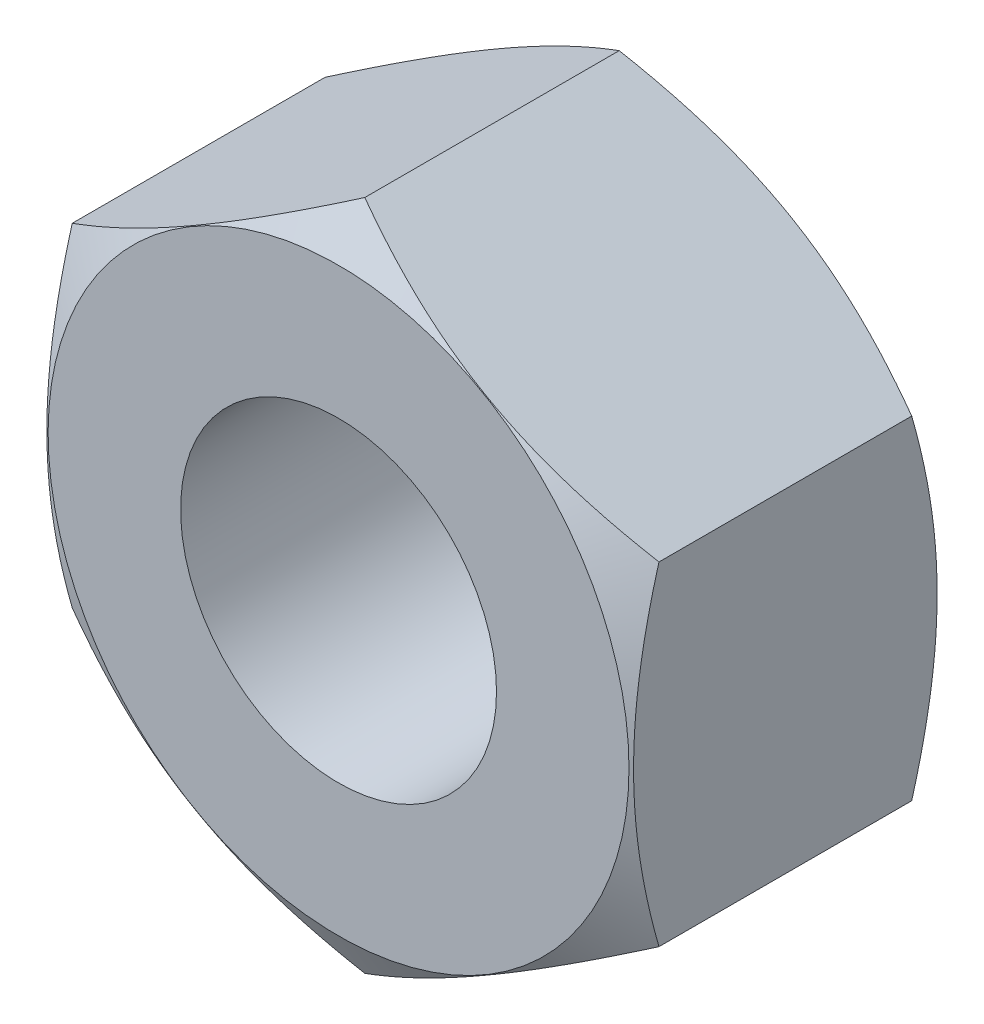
ISO-10303-21;
HEADER;
FILE_DESCRIPTION(('STEP AP214'),'2;1');
FILE_NAME('part.step','',(''),(''),'','','');
FILE_SCHEMA(('AUTOMOTIVE_DESIGN { 1 0 10303 214 1 1 1 1 }'));
ENDSEC;
DATA;
#1=APPLICATION_CONTEXT('core data for automotive mechanical design processes');
#2=APPLICATION_PROTOCOL_DEFINITION('international standard','automotive_design',2000,#1);
#3=PRODUCT_CONTEXT('',#1,'mechanical');
#4=PRODUCT('Part','Part','',(#3));
#5=PRODUCT_RELATED_PRODUCT_CATEGORY('part','',(#4));
#6=PRODUCT_DEFINITION_FORMATION('','',#4);
#7=PRODUCT_DEFINITION_CONTEXT('part definition',#1,'design');
#8=PRODUCT_DEFINITION('design','',#6,#7);
#9=PRODUCT_DEFINITION_SHAPE('','',#8);
#10=(LENGTH_UNIT() NAMED_UNIT(*) SI_UNIT(.MILLI.,.METRE.));
#11=(NAMED_UNIT(*) PLANE_ANGLE_UNIT() SI_UNIT($,.RADIAN.));
#12=(NAMED_UNIT(*) SI_UNIT($,.STERADIAN.) SOLID_ANGLE_UNIT());
#13=UNCERTAINTY_MEASURE_WITH_UNIT(LENGTH_MEASURE(1.E-05),#10,'distance_accuracy_value','');
#14=(GEOMETRIC_REPRESENTATION_CONTEXT(3) GLOBAL_UNCERTAINTY_ASSIGNED_CONTEXT((#13)) GLOBAL_UNIT_ASSIGNED_CONTEXT((#10,
#11,#12)) REPRESENTATION_CONTEXT('',''));
#15=CARTESIAN_POINT('',(0.,0.,0.));
#16=DIRECTION('',(0.,0.,1.));
#17=DIRECTION('',(1.,0.,0.));
#18=AXIS2_PLACEMENT_3D('',#15,#16,#17);
#19=CARTESIAN_POINT('',(0.,0.,0.));
#20=DIRECTION('',(0.,0.,1.));
#21=DIRECTION('',(1.,0.,0.));
#22=AXIS2_PLACEMENT_3D('',#19,#20,#21);
#23=PLANE('',#22);
#24=CARTESIAN_POINT('',(0.,0.,0.));
#25=DIRECTION('',(0.,0.,1.));
#26=DIRECTION('',(1.,0.,0.));
#27=AXIS2_PLACEMENT_3D('',#24,#25,#26);
#28=CIRCLE('',#27,3.5);
#29=CARTESIAN_POINT('',(3.5,0.,0.));
#30=VERTEX_POINT('',#29);
#31=EDGE_CURVE('E218',#30,#30,#28,.T.);
#32=ORIENTED_EDGE('',*,*,#31,.T.);
#33=EDGE_LOOP('',(#32));
#34=FACE_BOUND('',#33,.T.);
#35=CARTESIAN_POINT('',(0.,0.,0.));
#36=DIRECTION('',(0.,0.,1.));
#37=DIRECTION('',(1.,0.,0.));
#38=AXIS2_PLACEMENT_3D('',#35,#36,#37);
#39=CIRCLE('',#38,6.43576951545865);
#40=CARTESIAN_POINT('',(6.43576951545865,0.,0.));
#41=VERTEX_POINT('',#40);
#42=EDGE_CURVE('E188',#41,#41,#39,.F.);
#43=ORIENTED_EDGE('',*,*,#42,.T.);
#44=EDGE_LOOP('',(#43));
#45=FACE_BOUND('',#44,.T.);
#46=ADVANCED_FACE('F27',(#34,#45),#23,.F.);
#47=CARTESIAN_POINT('',(0.,0.,0.600000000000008));
#48=DIRECTION('',(0.,0.,1.));
#49=DIRECTION('',(1.,0.,0.));
#50=AXIS2_PLACEMENT_3D('',#47,#48,#49);
#51=CONICAL_SURFACE('',#50,7.475,1.0471975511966);
#52=ORIENTED_EDGE('',*,*,#42,.F.);
#53=EDGE_LOOP('',(#52));
#54=FACE_BOUND('',#53,.T.);
#55=CARTESIAN_POINT('',(-6.5,-9.74231945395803,3.04603206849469));
#56=CARTESIAN_POINT('',(-6.5,-9.46314742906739,2.91199346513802));
#57=CARTESIAN_POINT('',(-6.5,-9.18330188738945,2.7793320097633));
#58=CARTESIAN_POINT('',(-6.5,-8.62190795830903,2.51753740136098));
#59=CARTESIAN_POINT('',(-6.5,-8.34035928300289,2.38840486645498));
#60=CARTESIAN_POINT('',(-6.5,-7.7737170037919,2.13377787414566));
#61=CARTESIAN_POINT('',(-6.5,-7.48861237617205,2.00830785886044));
#62=CARTESIAN_POINT('',(-6.5,-6.91604248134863,1.7628958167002));
#63=CARTESIAN_POINT('',(-6.5,-6.62857733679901,1.642953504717));
#64=CARTESIAN_POINT('',(-6.5,-6.04772360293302,1.40879881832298));
#65=CARTESIAN_POINT('',(-6.5,-5.75430454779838,1.2946615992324));
#66=CARTESIAN_POINT('',(-6.5,-5.16402976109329,1.0754827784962));
#67=CARTESIAN_POINT('',(-6.5,-4.86717367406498,0.970442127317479));
#68=CARTESIAN_POINT('',(-6.5,-4.27017248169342,0.772248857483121));
#69=CARTESIAN_POINT('',(-6.5,-3.97003563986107,0.67907161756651));
#70=CARTESIAN_POINT('',(-6.5,-3.36559758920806,0.50757556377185));
#71=CARTESIAN_POINT('',(-6.5,-3.06129765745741,0.429252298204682));
#72=CARTESIAN_POINT('',(-6.5,-2.44151271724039,0.289635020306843));
#73=CARTESIAN_POINT('',(-6.5,-2.12592995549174,0.228762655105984));
#74=CARTESIAN_POINT('',(-6.5,-1.64983467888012,0.155074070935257));
#75=CARTESIAN_POINT('',(-6.5,-1.4906633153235,0.133446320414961));
#76=CARTESIAN_POINT('',(-6.5,-1.1715966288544,0.0964905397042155));
#77=CARTESIAN_POINT('',(-6.5,-1.01170137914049,0.081161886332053));
#78=CARTESIAN_POINT('',(-6.5,-0.692351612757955,0.0572115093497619));
#79=CARTESIAN_POINT('',(-6.5,-0.532900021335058,0.0485509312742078));
#80=CARTESIAN_POINT('',(-6.5,-0.213773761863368,0.0379860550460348));
#81=CARTESIAN_POINT('',(-6.5,-0.0540990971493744,0.0360816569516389));
#82=CARTESIAN_POINT('',(-6.5,0.265143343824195,0.0390742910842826));
#83=CARTESIAN_POINT('',(-6.5,0.424711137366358,0.0439694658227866));
#84=CARTESIAN_POINT('',(-6.5,0.743503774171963,0.0604413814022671));
#85=CARTESIAN_POINT('',(-6.5,0.902728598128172,0.0720184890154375));
#86=CARTESIAN_POINT('',(-6.5,1.29058202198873,0.108118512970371));
#87=CARTESIAN_POINT('',(-6.5,1.5188950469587,0.136097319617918));
#88=CARTESIAN_POINT('',(-6.5,1.97368947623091,0.204220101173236));
#89=CARTESIAN_POINT('',(-6.5,2.20017059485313,0.244365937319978));
#90=CARTESIAN_POINT('',(-6.5,2.87728306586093,0.381035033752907));
#91=CARTESIAN_POINT('',(-6.5,3.32469250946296,0.493696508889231));
#92=CARTESIAN_POINT('',(-6.5,3.99374728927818,0.687398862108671));
#93=CARTESIAN_POINT('',(-6.5,4.21890306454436,0.756998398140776));
#94=CARTESIAN_POINT('',(-6.5,4.66703989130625,0.903002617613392));
#95=CARTESIAN_POINT('',(-6.5,4.89002074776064,0.979407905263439));
#96=CARTESIAN_POINT('',(-6.5,5.33269256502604,1.13739679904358));
#97=CARTESIAN_POINT('',(-6.5,5.55239501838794,1.21894852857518));
#98=CARTESIAN_POINT('',(-6.5,5.98994019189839,1.38668810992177));
#99=CARTESIAN_POINT('',(-6.5,6.20778352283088,1.47287436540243));
#100=CARTESIAN_POINT('',(-6.5,6.42484560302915,1.56094206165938));
#101=B_SPLINE_CURVE_WITH_KNOTS('',3,(#55,#56,#57,#58,#59,#60,#61,#62,#63,#64,#65,#66,#67,#68,
#69,#70,#71,#72,#73,#74,#75,#76,#77,#78,#79,#80,#81,#82,#83,#84,#85,#86,#87,#88,#89,#90,#91,#92,
#93,#94,#95,#96,#97,#98,#99,#100),.UNSPECIFIED.,.F.,.F.,(4,2,2,2,2,2,2,2,2,2,2,2,2,2,2,2,2,2,2,
2,2,2,4),(0.,0.929060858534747,1.85828342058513,2.79271315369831,3.72709463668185,
4.67148670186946,5.61597732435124,6.55847464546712,7.50068905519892,8.46404999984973,
8.94584702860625,9.42759638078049,9.90651690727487,10.385430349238,10.8642129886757,
11.3430219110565,12.0326915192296,12.7224666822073,14.1046928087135,14.8116425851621,
15.5186551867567,16.2216521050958,16.9244084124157),.UNSPECIFIED.);
#102=CARTESIAN_POINT('',(-6.5,-3.69129042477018,0.600000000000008));
#103=VERTEX_POINT('',#102);
#104=CARTESIAN_POINT('',(-6.5,3.69129042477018,0.600000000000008));
#105=VERTEX_POINT('',#104);
#106=EDGE_CURVE('E82',#103,#105,#101,.T.);
#107=ORIENTED_EDGE('',*,*,#106,.T.);
#108=CARTESIAN_POINT('',(-6.5002,3.69117495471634,0.600067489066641));
#109=CARTESIAN_POINT('',(-6.21605663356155,3.85522520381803,0.504144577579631));
#110=CARTESIAN_POINT('',(-5.92939800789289,4.02072763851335,0.416694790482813));
#111=CARTESIAN_POINT('',(-5.35104770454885,4.35463834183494,0.263540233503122));
#112=CARTESIAN_POINT('',(-5.0593452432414,4.52305283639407,0.197890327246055));
#113=CARTESIAN_POINT('',(-4.62271930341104,4.7751389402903,0.120365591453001));
#114=CARTESIAN_POINT('',(-4.47917121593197,4.85801646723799,0.0981728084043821));
#115=CARTESIAN_POINT('',(-4.19140690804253,5.02415726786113,0.0607037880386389));
#116=CARTESIAN_POINT('',(-4.04719074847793,5.10742050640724,0.0454269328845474));
#117=CARTESIAN_POINT('',(-3.75848206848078,5.27410654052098,0.0221782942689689));
#118=CARTESIAN_POINT('',(-3.61399006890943,5.35752903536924,0.0141979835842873));
#119=CARTESIAN_POINT('',(-3.32485183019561,5.52446307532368,0.00570797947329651));
#120=CARTESIAN_POINT('',(-3.18020559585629,5.60797461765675,0.00519805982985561));
#121=CARTESIAN_POINT('',(-2.7814976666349,5.83816874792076,0.0141502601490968));
#122=CARTESIAN_POINT('',(-2.52753973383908,5.98479142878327,0.031457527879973));
#123=CARTESIAN_POINT('',(-2.02127607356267,6.27708288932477,0.0879900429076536));
#124=CARTESIAN_POINT('',(-1.76897217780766,6.42275061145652,0.127236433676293));
#125=CARTESIAN_POINT('',(-1.2615682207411,6.71570042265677,0.226042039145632));
#126=CARTESIAN_POINT('',(-1.00653389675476,6.86294455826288,0.286040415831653));
#127=CARTESIAN_POINT('',(-0.500325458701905,7.15520413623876,0.422579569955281));
#128=CARTESIAN_POINT('',(-0.249144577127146,7.30022348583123,0.499086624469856));
#129=CARTESIAN_POINT('',(0.000200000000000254,7.44418264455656,0.582207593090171));
#130=B_SPLINE_CURVE_WITH_KNOTS('',3,(#108,#109,#110,#111,#112,#113,#114,#115,#116,#117,#118,
#119,#120,#121,#122,#123,#124,#125,#126,#127,#128,#129),.UNSPECIFIED.,.F.,.F.,(4,2,2,2,2,2,2,2,
2,2,4),(0.,1.02604980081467,2.05466262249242,2.55623205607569,3.05775667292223,3.55869442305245,
4.05961700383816,4.93992935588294,5.8210915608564,6.72217457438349,7.62143404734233),.UNSPECIFIED.);
#131=CARTESIAN_POINT('',(0.,7.44406717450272,0.58214092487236));
#132=VERTEX_POINT('',#131);
#133=EDGE_CURVE('E187',#105,#132,#130,.T.);
#134=ORIENTED_EDGE('',*,*,#133,.T.);
#135=CARTESIAN_POINT('',(-0.000199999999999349,7.44418264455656,0.582207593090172));
#136=CARTESIAN_POINT('',(0.141515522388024,7.36236314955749,0.534976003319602));
#137=CARTESIAN_POINT('',(0.283759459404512,7.28023857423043,0.489888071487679));
#138=CARTESIAN_POINT('',(0.569402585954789,7.11532243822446,0.404589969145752));
#139=CARTESIAN_POINT('',(0.712802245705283,7.03253060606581,0.36438190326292));
#140=CARTESIAN_POINT('',(1.14529960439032,6.78282813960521,0.251866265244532));
#141=CARTESIAN_POINT('',(1.43610465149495,6.61493176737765,0.187869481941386));
#142=CARTESIAN_POINT('',(1.87127050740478,6.36368864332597,0.112831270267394));
#143=CARTESIAN_POINT('',(2.01433090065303,6.28109268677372,0.0914569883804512));
#144=CARTESIAN_POINT('',(2.30109802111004,6.11552761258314,0.0556154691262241));
#145=CARTESIAN_POINT('',(2.44480469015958,6.03255852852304,0.0411476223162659));
#146=CARTESIAN_POINT('',(2.73246654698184,5.86647687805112,0.0194878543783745));
#147=CARTESIAN_POINT('',(2.87642126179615,5.78336458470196,0.0122876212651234));
#148=CARTESIAN_POINT('',(3.16445581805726,5.6170677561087,0.00530908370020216));
#149=CARTESIAN_POINT('',(3.30853565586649,5.53388322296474,0.00553057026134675));
#150=CARTESIAN_POINT('',(3.70778308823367,5.30337761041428,0.0164648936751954));
#151=CARTESIAN_POINT('',(3.96281557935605,5.15613453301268,0.0351473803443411));
#152=CARTESIAN_POINT('',(4.47113973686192,4.86265344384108,0.0945002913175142));
#153=CARTESIAN_POINT('',(4.72442945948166,4.7164165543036,0.135192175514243));
#154=CARTESIAN_POINT('',(5.23378531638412,4.42233981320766,0.236900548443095));
#155=CARTESIAN_POINT('',(5.48978382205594,4.27453900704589,0.298357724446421));
#156=CARTESIAN_POINT('',(5.99786442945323,3.98119853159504,0.437737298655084));
#157=CARTESIAN_POINT('',(6.24995353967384,3.8356548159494,0.515625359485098));
#158=CARTESIAN_POINT('',(6.5002,3.69117495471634,0.600067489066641));
#159=B_SPLINE_CURVE_WITH_KNOTS('',3,(#135,#136,#137,#138,#139,#140,#141,#142,#143,#144,#145,
#146,#147,#148,#149,#150,#151,#152,#153,#154,#155,#156,#157,#158),.UNSPECIFIED.,.F.,.F.,(4,2,2,
2,2,2,2,2,2,2,2,4),(0.,0.51091601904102,1.02205161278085,2.04645475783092,2.54604508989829,
3.04559132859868,3.54456558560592,4.04352579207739,4.92779781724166,5.81293359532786,
6.71817569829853,7.62154443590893),.UNSPECIFIED.);
#160=CARTESIAN_POINT('',(6.5,3.69129042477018,0.600000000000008));
#161=VERTEX_POINT('',#160);
#162=EDGE_CURVE('E184',#132,#161,#159,.T.);
#163=ORIENTED_EDGE('',*,*,#162,.T.);
#164=CARTESIAN_POINT('',(6.5,-9.74231945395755,3.04603206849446));
#165=CARTESIAN_POINT('',(6.5,-9.4631474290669,2.91199346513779));
#166=CARTESIAN_POINT('',(6.5,-9.18330188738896,2.77933200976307));
#167=CARTESIAN_POINT('',(6.5,-8.62190795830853,2.51753740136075));
#168=CARTESIAN_POINT('',(6.5,-8.34035928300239,2.38840486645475));
#169=CARTESIAN_POINT('',(6.5,-7.77371700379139,2.13377787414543));
#170=CARTESIAN_POINT('',(6.5,-7.48861237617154,2.00830785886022));
#171=CARTESIAN_POINT('',(6.5,-6.91604248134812,1.76289581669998));
#172=CARTESIAN_POINT('',(6.5,-6.62857733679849,1.64295350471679));
#173=CARTESIAN_POINT('',(6.5,-6.04772360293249,1.40879881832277));
#174=CARTESIAN_POINT('',(6.5,-5.75430454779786,1.2946615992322));
#175=CARTESIAN_POINT('',(6.5,-5.16402976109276,1.07548277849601));
#176=CARTESIAN_POINT('',(6.5,-4.86717367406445,0.970442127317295));
#177=CARTESIAN_POINT('',(6.5,-4.27017248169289,0.772248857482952));
#178=CARTESIAN_POINT('',(6.5,-3.97003563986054,0.679071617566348));
#179=CARTESIAN_POINT('',(6.5,-3.36559758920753,0.507575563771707));
#180=CARTESIAN_POINT('',(6.5,-3.06129765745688,0.42925229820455));
#181=CARTESIAN_POINT('',(6.5,-2.44151271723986,0.289635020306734));
#182=CARTESIAN_POINT('',(6.5,-2.12592995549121,0.228762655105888));
#183=CARTESIAN_POINT('',(6.5,-1.64983467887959,0.155074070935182));
#184=CARTESIAN_POINT('',(6.5,-1.49066331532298,0.133446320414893));
#185=CARTESIAN_POINT('',(6.5,-1.17159662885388,0.0964905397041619));
#186=CARTESIAN_POINT('',(6.5,-1.01170137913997,0.0811618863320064));
#187=CARTESIAN_POINT('',(6.5,-0.692351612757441,0.0572115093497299));
#188=CARTESIAN_POINT('',(6.5,-0.532900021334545,0.0485509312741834));
#189=CARTESIAN_POINT('',(6.5,-0.213773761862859,0.037986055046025));
#190=CARTESIAN_POINT('',(6.5,-0.0540990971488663,0.0360816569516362));
#191=CARTESIAN_POINT('',(6.5,0.265143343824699,0.0390742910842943));
#192=CARTESIAN_POINT('',(6.5,0.424711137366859,0.0439694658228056));
#193=CARTESIAN_POINT('',(6.5,0.74350377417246,0.0604413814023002));
#194=CARTESIAN_POINT('',(6.5,0.902728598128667,0.0720184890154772));
#195=CARTESIAN_POINT('',(6.5,1.29058202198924,0.108118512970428));
#196=CARTESIAN_POINT('',(6.5,1.51889504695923,0.136097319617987));
#197=CARTESIAN_POINT('',(6.5,1.97368947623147,0.20422010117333));
#198=CARTESIAN_POINT('',(6.5,2.20017059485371,0.244365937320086));
#199=CARTESIAN_POINT('',(6.5,2.87728306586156,0.381035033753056));
#200=CARTESIAN_POINT('',(6.5,3.32469250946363,0.493696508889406));
#201=CARTESIAN_POINT('',(6.5,3.99374728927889,0.687398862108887));
#202=CARTESIAN_POINT('',(6.5,4.21890306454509,0.756998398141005));
#203=CARTESIAN_POINT('',(6.5,4.66703989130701,0.903002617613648));
#204=CARTESIAN_POINT('',(6.5,4.89002074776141,0.979407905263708));
#205=CARTESIAN_POINT('',(6.5,5.33269256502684,1.13739679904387));
#206=CARTESIAN_POINT('',(6.5,5.55239501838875,1.21894852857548));
#207=CARTESIAN_POINT('',(6.5,5.98994019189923,1.3866881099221));
#208=CARTESIAN_POINT('',(6.5,6.20778352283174,1.47287436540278));
#209=CARTESIAN_POINT('',(6.5,6.42484560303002,1.56094206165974));
#210=B_SPLINE_CURVE_WITH_KNOTS('',3,(#164,#165,#166,#167,#168,#169,#170,#171,#172,#173,#174,
#175,#176,#177,#178,#179,#180,#181,#182,#183,#184,#185,#186,#187,#188,#189,#190,#191,#192,#193,
#194,#195,#196,#197,#198,#199,#200,#201,#202,#203,#204,#205,#206,#207,#208,#209),.UNSPECIFIED.,
.F.,.F.,(4,2,2,2,2,2,2,2,2,2,2,2,2,2,2,2,2,2,2,2,2,2,4),(0.,0.929060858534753,1.85828342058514,
2.79271315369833,3.72709463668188,4.67148670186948,5.61597732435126,6.55847464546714,
7.50068905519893,8.46404999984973,8.94584702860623,9.42759638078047,9.90651690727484,
10.385430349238,10.8642129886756,11.3430219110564,12.0326915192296,12.7224666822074,
14.1046928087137,14.8116425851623,15.518655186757,16.2216521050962,16.9244084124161),.UNSPECIFIED.);
#211=CARTESIAN_POINT('',(6.5,-3.69129042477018,0.600000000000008));
#212=VERTEX_POINT('',#211);
#213=EDGE_CURVE('E104',#161,#212,#210,.F.);
#214=ORIENTED_EDGE('',*,*,#213,.T.);
#215=CARTESIAN_POINT('',(6.5002,-3.69117495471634,0.600067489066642));
#216=CARTESIAN_POINT('',(6.21605663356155,-3.85522520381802,0.504144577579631));
#217=CARTESIAN_POINT('',(5.92939800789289,-4.02072763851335,0.416694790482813));
#218=CARTESIAN_POINT('',(5.35104770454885,-4.35463834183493,0.263540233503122));
#219=CARTESIAN_POINT('',(5.0593452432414,-4.52305283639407,0.197890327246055));
#220=CARTESIAN_POINT('',(4.62271930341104,-4.7751389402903,0.120365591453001));
#221=CARTESIAN_POINT('',(4.47917121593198,-4.85801646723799,0.098172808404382));
#222=CARTESIAN_POINT('',(4.19140690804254,-5.02415726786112,0.0607037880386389));
#223=CARTESIAN_POINT('',(4.04719074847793,-5.10742050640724,0.0454269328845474));
#224=CARTESIAN_POINT('',(3.75848206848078,-5.27410654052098,0.0221782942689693));
#225=CARTESIAN_POINT('',(3.61399006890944,-5.35752903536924,0.0141979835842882));
#226=CARTESIAN_POINT('',(3.32485183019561,-5.52446307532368,0.00570797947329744));
#227=CARTESIAN_POINT('',(3.18020559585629,-5.60797461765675,0.00519805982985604));
#228=CARTESIAN_POINT('',(2.7814976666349,-5.83816874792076,0.0141502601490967));
#229=CARTESIAN_POINT('',(2.52753973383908,-5.98479142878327,0.0314575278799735));
#230=CARTESIAN_POINT('',(2.02127607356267,-6.27708288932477,0.0879900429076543));
#231=CARTESIAN_POINT('',(1.76897217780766,-6.42275061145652,0.127236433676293));
#232=CARTESIAN_POINT('',(1.2615682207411,-6.71570042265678,0.226042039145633));
#233=CARTESIAN_POINT('',(1.00653389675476,-6.86294455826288,0.286040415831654));
#234=CARTESIAN_POINT('',(0.500325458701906,-7.15520413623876,0.422579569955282));
#235=CARTESIAN_POINT('',(0.249144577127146,-7.30022348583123,0.499086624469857));
#236=CARTESIAN_POINT('',(-0.000200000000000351,-7.44418264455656,0.582207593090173));
#237=B_SPLINE_CURVE_WITH_KNOTS('',3,(#215,#216,#217,#218,#219,#220,#221,#222,#223,#224,#225,
#226,#227,#228,#229,#230,#231,#232,#233,#234,#235,#236),.UNSPECIFIED.,.F.,.F.,(4,2,2,2,2,2,2,2,
2,2,4),(0.,1.02604980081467,2.05466262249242,2.55623205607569,3.05775667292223,3.55869442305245,
4.05961700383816,4.93992935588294,5.8210915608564,6.72217457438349,7.62143404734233),.UNSPECIFIED.);
#238=CARTESIAN_POINT('',(0.,-7.44406717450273,0.582140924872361));
#239=VERTEX_POINT('',#238);
#240=EDGE_CURVE('E102',#212,#239,#237,.T.);
#241=ORIENTED_EDGE('',*,*,#240,.T.);
#242=CARTESIAN_POINT('',(0.000200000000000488,-7.44418264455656,0.582207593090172));
#243=CARTESIAN_POINT('',(-0.141515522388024,-7.36236314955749,0.534976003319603));
#244=CARTESIAN_POINT('',(-0.283759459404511,-7.28023857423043,0.489888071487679));
#245=CARTESIAN_POINT('',(-0.569402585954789,-7.11532243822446,0.404589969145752));
#246=CARTESIAN_POINT('',(-0.712802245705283,-7.03253060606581,0.36438190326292));
#247=CARTESIAN_POINT('',(-1.14529960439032,-6.78282813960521,0.251866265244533));
#248=CARTESIAN_POINT('',(-1.43610465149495,-6.61493176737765,0.187869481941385));
#249=CARTESIAN_POINT('',(-1.87127050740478,-6.36368864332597,0.112831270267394));
#250=CARTESIAN_POINT('',(-2.01433090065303,-6.28109268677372,0.0914569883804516));
#251=CARTESIAN_POINT('',(-2.30109802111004,-6.11552761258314,0.0556154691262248));
#252=CARTESIAN_POINT('',(-2.44480469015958,-6.03255852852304,0.0411476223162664));
#253=CARTESIAN_POINT('',(-2.73246654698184,-5.86647687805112,0.0194878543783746));
#254=CARTESIAN_POINT('',(-2.87642126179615,-5.78336458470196,0.0122876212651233));
#255=CARTESIAN_POINT('',(-3.16445581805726,-5.6170677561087,0.00530908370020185));
#256=CARTESIAN_POINT('',(-3.30853565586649,-5.53388322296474,0.00553057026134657));
#257=CARTESIAN_POINT('',(-3.70778308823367,-5.30337761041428,0.0164648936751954));
#258=CARTESIAN_POINT('',(-3.96281557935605,-5.15613453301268,0.0351473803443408));
#259=CARTESIAN_POINT('',(-4.47113973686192,-4.86265344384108,0.0945002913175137));
#260=CARTESIAN_POINT('',(-4.72442945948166,-4.7164165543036,0.135192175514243));
#261=CARTESIAN_POINT('',(-5.23378531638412,-4.42233981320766,0.236900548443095));
#262=CARTESIAN_POINT('',(-5.48978382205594,-4.27453900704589,0.298357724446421));
#263=CARTESIAN_POINT('',(-5.99786442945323,-3.98119853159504,0.437737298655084));
#264=CARTESIAN_POINT('',(-6.24995353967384,-3.8356548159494,0.515625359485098));
#265=CARTESIAN_POINT('',(-6.5002,-3.69117495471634,0.600067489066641));
#266=B_SPLINE_CURVE_WITH_KNOTS('',3,(#242,#243,#244,#245,#246,#247,#248,#249,#250,#251,#252,
#253,#254,#255,#256,#257,#258,#259,#260,#261,#262,#263,#264,#265),.UNSPECIFIED.,.F.,.F.,(4,2,2,
2,2,2,2,2,2,2,2,4),(0.,0.510916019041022,1.02205161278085,2.04645475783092,2.54604508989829,
3.04559132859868,3.54456558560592,4.04352579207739,4.92779781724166,5.81293359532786,
6.71817569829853,7.62154443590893),.UNSPECIFIED.);
#267=EDGE_CURVE('E87',#239,#103,#266,.T.);
#268=ORIENTED_EDGE('',*,*,#267,.T.);
#269=EDGE_LOOP('',(#107,#134,#163,#214,#241,#268));
#270=FACE_BOUND('',#269,.T.);
#271=ADVANCED_FACE('F100',(#54,#270),#51,.T.);
#272=CARTESIAN_POINT('',(0.,7.44406717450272,0.));
#273=DIRECTION('',(-0.499999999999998,0.86602540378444,0.));
#274=DIRECTION('',(-0.86602540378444,-0.499999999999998,0.));
#275=AXIS2_PLACEMENT_3D('',#272,#273,#274);
#276=PLANE('',#275);
#277=ORIENTED_EDGE('',*,*,#133,.F.);
#278=DIRECTION('',(0.,0.,1.));
#279=VECTOR('',#278,1.);
#280=CARTESIAN_POINT('',(-6.5,3.69129042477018,0.));
#281=LINE('',#280,#279);
#282=CARTESIAN_POINT('',(-6.5,3.69129042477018,6.19999999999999));
#283=VERTEX_POINT('',#282);
#284=EDGE_CURVE('E47',#105,#283,#281,.T.);
#285=ORIENTED_EDGE('',*,*,#284,.T.);
#286=CARTESIAN_POINT('',(0.000200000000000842,7.44418264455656,6.21779240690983));
#287=CARTESIAN_POINT('',(-0.141515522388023,7.36236314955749,6.2650239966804));
#288=CARTESIAN_POINT('',(-0.283759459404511,7.28023857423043,6.31011192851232));
#289=CARTESIAN_POINT('',(-0.569402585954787,7.11532243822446,6.39541003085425));
#290=CARTESIAN_POINT('',(-0.712802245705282,7.03253060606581,6.43561809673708));
#291=CARTESIAN_POINT('',(-1.14529960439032,6.78282813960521,6.54813373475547));
#292=CARTESIAN_POINT('',(-1.43610465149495,6.61493176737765,6.61213051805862));
#293=CARTESIAN_POINT('',(-1.87127050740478,6.36368864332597,6.68716872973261));
#294=CARTESIAN_POINT('',(-2.01433090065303,6.28109268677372,6.70854301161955));
#295=CARTESIAN_POINT('',(-2.30109802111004,6.11552761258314,6.74438453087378));
#296=CARTESIAN_POINT('',(-2.44480469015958,6.03255852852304,6.75885237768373));
#297=CARTESIAN_POINT('',(-2.73246654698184,5.86647687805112,6.78051214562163));
#298=CARTESIAN_POINT('',(-2.87642126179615,5.78336458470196,6.78771237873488));
#299=CARTESIAN_POINT('',(-3.16445581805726,5.6170677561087,6.7946909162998));
#300=CARTESIAN_POINT('',(-3.30853565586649,5.53388322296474,6.79446942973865));
#301=CARTESIAN_POINT('',(-3.70778308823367,5.30337761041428,6.7835351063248));
#302=CARTESIAN_POINT('',(-3.96281557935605,5.15613453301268,6.76485261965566));
#303=CARTESIAN_POINT('',(-4.47113973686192,4.86265344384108,6.70549970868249));
#304=CARTESIAN_POINT('',(-4.72442945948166,4.7164165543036,6.66480782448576));
#305=CARTESIAN_POINT('',(-5.23378531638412,4.42233981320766,6.5630994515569));
#306=CARTESIAN_POINT('',(-5.48978382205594,4.27453900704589,6.50164227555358));
#307=CARTESIAN_POINT('',(-5.99786442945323,3.98119853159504,6.36226270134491));
#308=CARTESIAN_POINT('',(-6.24995353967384,3.8356548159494,6.2843746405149));
#309=CARTESIAN_POINT('',(-6.5002,3.69117495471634,6.19993251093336));
#310=B_SPLINE_CURVE_WITH_KNOTS('',3,(#286,#287,#288,#289,#290,#291,#292,#293,#294,#295,#296,
#297,#298,#299,#300,#301,#302,#303,#304,#305,#306,#307,#308,#309),.UNSPECIFIED.,.F.,.F.,(4,2,2,
2,2,2,2,2,2,2,2,4),(0.,0.510916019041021,1.02205161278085,2.04645475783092,2.54604508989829,
3.04559132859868,3.54456558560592,4.04352579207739,4.92779781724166,5.81293359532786,
6.71817569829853,7.62154443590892),.UNSPECIFIED.);
#311=CARTESIAN_POINT('',(0.,7.44406717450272,6.21785907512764));
#312=VERTEX_POINT('',#311);
#313=EDGE_CURVE('E11',#312,#283,#310,.T.);
#314=ORIENTED_EDGE('',*,*,#313,.F.);
#315=DIRECTION('',(0.,0.,1.));
#316=VECTOR('',#315,1.);
#317=CARTESIAN_POINT('',(0.,7.44406717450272,0.));
#318=LINE('',#317,#316);
#319=EDGE_CURVE('E88',#132,#312,#318,.T.);
#320=ORIENTED_EDGE('',*,*,#319,.F.);
#321=EDGE_LOOP('',(#277,#285,#314,#320));
#322=FACE_BOUND('',#321,.T.);
#323=ADVANCED_FACE('F186',(#322),#276,.T.);
#324=CARTESIAN_POINT('',(6.5,3.69129042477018,0.));
#325=DIRECTION('',(0.499999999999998,0.86602540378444,0.));
#326=DIRECTION('',(-0.86602540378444,0.499999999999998,0.));
#327=AXIS2_PLACEMENT_3D('',#324,#325,#326);
#328=PLANE('',#327);
#329=ORIENTED_EDGE('',*,*,#162,.F.);
#330=ORIENTED_EDGE('',*,*,#319,.T.);
#331=CARTESIAN_POINT('',(6.5002,3.69117495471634,6.19993251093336));
#332=CARTESIAN_POINT('',(6.21605663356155,3.85522520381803,6.29585542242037));
#333=CARTESIAN_POINT('',(5.92939800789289,4.02072763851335,6.38330520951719));
#334=CARTESIAN_POINT('',(5.35104770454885,4.35463834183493,6.53645976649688));
#335=CARTESIAN_POINT('',(5.0593452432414,4.52305283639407,6.60210967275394));
#336=CARTESIAN_POINT('',(4.62271930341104,4.7751389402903,6.679634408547));
#337=CARTESIAN_POINT('',(4.47917121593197,4.85801646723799,6.70182719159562));
#338=CARTESIAN_POINT('',(4.19140690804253,5.02415726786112,6.73929621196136));
#339=CARTESIAN_POINT('',(4.04719074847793,5.10742050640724,6.75457306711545));
#340=CARTESIAN_POINT('',(3.75848206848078,5.27410654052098,6.77782170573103));
#341=CARTESIAN_POINT('',(3.61399006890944,5.35752903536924,6.78580201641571));
#342=CARTESIAN_POINT('',(3.32485183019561,5.52446307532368,6.7942920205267));
#343=CARTESIAN_POINT('',(3.18020559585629,5.60797461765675,6.79480194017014));
#344=CARTESIAN_POINT('',(2.7814976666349,5.83816874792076,6.7858497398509));
#345=CARTESIAN_POINT('',(2.52753973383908,5.98479142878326,6.76854247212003));
#346=CARTESIAN_POINT('',(2.02127607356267,6.27708288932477,6.71200995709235));
#347=CARTESIAN_POINT('',(1.76897217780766,6.42275061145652,6.67276356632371));
#348=CARTESIAN_POINT('',(1.26156822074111,6.71570042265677,6.57395796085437));
#349=CARTESIAN_POINT('',(1.00653389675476,6.86294455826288,6.51395958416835));
#350=CARTESIAN_POINT('',(0.500325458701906,7.15520413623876,6.37742043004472));
#351=CARTESIAN_POINT('',(0.249144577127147,7.30022348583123,6.30091337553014));
#352=CARTESIAN_POINT('',(-0.000199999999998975,7.44418264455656,6.21779240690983));
#353=B_SPLINE_CURVE_WITH_KNOTS('',3,(#331,#332,#333,#334,#335,#336,#337,#338,#339,#340,#341,
#342,#343,#344,#345,#346,#347,#348,#349,#350,#351,#352),.UNSPECIFIED.,.F.,.F.,(4,2,2,2,2,2,2,2,
2,2,4),(0.,1.02604980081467,2.05466262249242,2.55623205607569,3.05775667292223,3.55869442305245,
4.05961700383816,4.93992935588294,5.8210915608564,6.72217457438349,7.62143404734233),.UNSPECIFIED.);
#354=CARTESIAN_POINT('',(6.5,3.69129042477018,6.19999999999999));
#355=VERTEX_POINT('',#354);
#356=EDGE_CURVE('E40',#355,#312,#353,.T.);
#357=ORIENTED_EDGE('',*,*,#356,.F.);
#358=DIRECTION('',(0.,0.,1.));
#359=VECTOR('',#358,1.);
#360=CARTESIAN_POINT('',(6.5,3.69129042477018,0.));
#361=LINE('',#360,#359);
#362=EDGE_CURVE('E174',#161,#355,#361,.T.);
#363=ORIENTED_EDGE('',*,*,#362,.F.);
#364=EDGE_LOOP('',(#329,#330,#357,#363));
#365=FACE_BOUND('',#364,.T.);
#366=ADVANCED_FACE('F151',(#365),#328,.T.);
#367=CARTESIAN_POINT('',(6.5,-3.69129042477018,0.));
#368=DIRECTION('',(1.,0.,0.));
#369=DIRECTION('',(0.,0.,-1.));
#370=AXIS2_PLACEMENT_3D('',#367,#368,#369);
#371=PLANE('',#370);
#372=ORIENTED_EDGE('',*,*,#213,.F.);
#373=ORIENTED_EDGE('',*,*,#362,.T.);
#374=CARTESIAN_POINT('',(6.5,-9.74231945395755,3.75396793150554));
#375=CARTESIAN_POINT('',(6.5,-9.4631474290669,3.88800653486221));
#376=CARTESIAN_POINT('',(6.5,-9.18330188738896,4.02066799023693));
#377=CARTESIAN_POINT('',(6.5,-8.62190795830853,4.28246259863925));
#378=CARTESIAN_POINT('',(6.5,-8.34035928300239,4.41159513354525));
#379=CARTESIAN_POINT('',(6.5,-7.7737170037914,4.66622212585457));
#380=CARTESIAN_POINT('',(6.5,-7.48861237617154,4.79169214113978));
#381=CARTESIAN_POINT('',(6.5,-6.91604248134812,5.03710418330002));
#382=CARTESIAN_POINT('',(6.5,-6.62857733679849,5.15704649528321));
#383=CARTESIAN_POINT('',(6.5,-6.04772360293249,5.39120118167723));
#384=CARTESIAN_POINT('',(6.5,-5.75430454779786,5.5053384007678));
#385=CARTESIAN_POINT('',(6.5,-5.16402976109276,5.72451722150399));
#386=CARTESIAN_POINT('',(6.5,-4.86717367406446,5.82955787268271));
#387=CARTESIAN_POINT('',(6.5,-4.27017248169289,6.02775114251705));
#388=CARTESIAN_POINT('',(6.5,-3.97003563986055,6.12092838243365));
#389=CARTESIAN_POINT('',(6.5,-3.36559758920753,6.29242443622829));
#390=CARTESIAN_POINT('',(6.5,-3.06129765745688,6.37074770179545));
#391=CARTESIAN_POINT('',(6.5,-2.44151271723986,6.51036497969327));
#392=CARTESIAN_POINT('',(6.5,-2.12592995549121,6.57123734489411));
#393=CARTESIAN_POINT('',(6.5,-1.64983467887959,6.64492592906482));
#394=CARTESIAN_POINT('',(6.5,-1.49066331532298,6.66655367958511));
#395=CARTESIAN_POINT('',(6.5,-1.17159662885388,6.70350946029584));
#396=CARTESIAN_POINT('',(6.5,-1.01170137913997,6.71883811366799));
#397=CARTESIAN_POINT('',(6.5,-0.69235161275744,6.74278849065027));
#398=CARTESIAN_POINT('',(6.5,-0.532900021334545,6.75144906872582));
#399=CARTESIAN_POINT('',(6.5,-0.213773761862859,6.76201394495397));
#400=CARTESIAN_POINT('',(6.5,-0.0540990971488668,6.76391834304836));
#401=CARTESIAN_POINT('',(6.5,0.265143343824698,6.76092570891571));
#402=CARTESIAN_POINT('',(6.5,0.424711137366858,6.75603053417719));
#403=CARTESIAN_POINT('',(6.5,0.74350377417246,6.7395586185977));
#404=CARTESIAN_POINT('',(6.5,0.902728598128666,6.72798151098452));
#405=CARTESIAN_POINT('',(6.5,1.29058202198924,6.69188148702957));
#406=CARTESIAN_POINT('',(6.5,1.51889504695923,6.66390268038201));
#407=CARTESIAN_POINT('',(6.5,1.97368947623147,6.59577989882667));
#408=CARTESIAN_POINT('',(6.5,2.2001705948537,6.55563406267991));
#409=CARTESIAN_POINT('',(6.5,2.87728306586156,6.41896496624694));
#410=CARTESIAN_POINT('',(6.5,3.32469250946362,6.30630349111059));
#411=CARTESIAN_POINT('',(6.5,3.99374728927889,6.11260113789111));
#412=CARTESIAN_POINT('',(6.5,4.21890306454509,6.04300160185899));
#413=CARTESIAN_POINT('',(6.5,4.667039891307,5.89699738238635));
#414=CARTESIAN_POINT('',(6.5,4.89002074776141,5.82059209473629));
#415=CARTESIAN_POINT('',(6.5,5.33269256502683,5.66260320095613));
#416=CARTESIAN_POINT('',(6.5,5.55239501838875,5.58105147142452));
#417=CARTESIAN_POINT('',(6.5,5.98994019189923,5.4133118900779));
#418=CARTESIAN_POINT('',(6.5,6.20778352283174,5.32712563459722));
#419=CARTESIAN_POINT('',(6.5,6.42484560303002,5.23905793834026));
#420=B_SPLINE_CURVE_WITH_KNOTS('',3,(#374,#375,#376,#377,#378,#379,#380,#381,#382,#383,#384,
#385,#386,#387,#388,#389,#390,#391,#392,#393,#394,#395,#396,#397,#398,#399,#400,#401,#402,#403,
#404,#405,#406,#407,#408,#409,#410,#411,#412,#413,#414,#415,#416,#417,#418,#419),.UNSPECIFIED.,
.F.,.F.,(4,2,2,2,2,2,2,2,2,2,2,2,2,2,2,2,2,2,2,2,2,2,4),(0.,0.929060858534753,1.85828342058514,
2.79271315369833,3.72709463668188,4.67148670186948,5.61597732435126,6.55847464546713,
7.50068905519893,8.46404999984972,8.94584702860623,9.42759638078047,9.90651690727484,
10.385430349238,10.8642129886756,11.3430219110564,12.0326915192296,12.7224666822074,
14.1046928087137,14.8116425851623,15.518655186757,16.2216521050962,16.9244084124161),.UNSPECIFIED.);
#421=CARTESIAN_POINT('',(6.5,-3.69129042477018,6.19999999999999));
#422=VERTEX_POINT('',#421);
#423=EDGE_CURVE('E158',#422,#355,#420,.T.);
#424=ORIENTED_EDGE('',*,*,#423,.F.);
#425=DIRECTION('',(0.,0.,1.));
#426=VECTOR('',#425,1.);
#427=CARTESIAN_POINT('',(6.5,-3.69129042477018,0.));
#428=LINE('',#427,#426);
#429=EDGE_CURVE('E172',#212,#422,#428,.T.);
#430=ORIENTED_EDGE('',*,*,#429,.F.);
#431=EDGE_LOOP('',(#372,#373,#424,#430));
#432=FACE_BOUND('',#431,.T.);
#433=ADVANCED_FACE('F245',(#432),#371,.T.);
#434=CARTESIAN_POINT('',(0.,-7.44406717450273,0.));
#435=DIRECTION('',(0.499999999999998,-0.86602540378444,0.));
#436=DIRECTION('',(0.86602540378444,0.499999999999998,0.));
#437=AXIS2_PLACEMENT_3D('',#434,#435,#436);
#438=PLANE('',#437);
#439=ORIENTED_EDGE('',*,*,#240,.F.);
#440=ORIENTED_EDGE('',*,*,#429,.T.);
#441=CARTESIAN_POINT('',(-0.000199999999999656,-7.44418264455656,6.21779240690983));
#442=CARTESIAN_POINT('',(0.141515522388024,-7.36236314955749,6.2650239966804));
#443=CARTESIAN_POINT('',(0.283759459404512,-7.28023857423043,6.31011192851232));
#444=CARTESIAN_POINT('',(0.569402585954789,-7.11532243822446,6.39541003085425));
#445=CARTESIAN_POINT('',(0.712802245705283,-7.03253060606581,6.43561809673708));
#446=CARTESIAN_POINT('',(1.14529960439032,-6.78282813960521,6.54813373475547));
#447=CARTESIAN_POINT('',(1.43610465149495,-6.61493176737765,6.61213051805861));
#448=CARTESIAN_POINT('',(1.87127050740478,-6.36368864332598,6.68716872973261));
#449=CARTESIAN_POINT('',(2.01433090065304,-6.28109268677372,6.70854301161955));
#450=CARTESIAN_POINT('',(2.30109802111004,-6.11552761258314,6.74438453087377));
#451=CARTESIAN_POINT('',(2.44480469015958,-6.03255852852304,6.75885237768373));
#452=CARTESIAN_POINT('',(2.73246654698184,-5.86647687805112,6.78051214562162));
#453=CARTESIAN_POINT('',(2.87642126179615,-5.78336458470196,6.78771237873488));
#454=CARTESIAN_POINT('',(3.16445581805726,-5.6170677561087,6.7946909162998));
#455=CARTESIAN_POINT('',(3.3085356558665,-5.53388322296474,6.79446942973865));
#456=CARTESIAN_POINT('',(3.70778308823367,-5.30337761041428,6.7835351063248));
#457=CARTESIAN_POINT('',(3.96281557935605,-5.15613453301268,6.76485261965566));
#458=CARTESIAN_POINT('',(4.47113973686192,-4.86265344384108,6.70549970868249));
#459=CARTESIAN_POINT('',(4.72442945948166,-4.7164165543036,6.66480782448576));
#460=CARTESIAN_POINT('',(5.23378531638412,-4.42233981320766,6.5630994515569));
#461=CARTESIAN_POINT('',(5.48978382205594,-4.27453900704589,6.50164227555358));
#462=CARTESIAN_POINT('',(5.99786442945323,-3.98119853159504,6.36226270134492));
#463=CARTESIAN_POINT('',(6.24995353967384,-3.8356548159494,6.2843746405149));
#464=CARTESIAN_POINT('',(6.5002,-3.69117495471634,6.19993251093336));
#465=B_SPLINE_CURVE_WITH_KNOTS('',3,(#441,#442,#443,#444,#445,#446,#447,#448,#449,#450,#451,
#452,#453,#454,#455,#456,#457,#458,#459,#460,#461,#462,#463,#464),.UNSPECIFIED.,.F.,.F.,(4,2,2,
2,2,2,2,2,2,2,2,4),(0.,0.51091601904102,1.02205161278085,2.04645475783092,2.54604508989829,
3.04559132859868,3.54456558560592,4.04352579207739,4.92779781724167,5.81293359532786,
6.71817569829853,7.62154443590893),.UNSPECIFIED.);
#466=CARTESIAN_POINT('',(0.,-7.44406717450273,6.21785907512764));
#467=VERTEX_POINT('',#466);
#468=EDGE_CURVE('E135',#467,#422,#465,.T.);
#469=ORIENTED_EDGE('',*,*,#468,.F.);
#470=DIRECTION('',(0.,0.,1.));
#471=VECTOR('',#470,1.);
#472=CARTESIAN_POINT('',(0.,-7.44406717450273,0.));
#473=LINE('',#472,#471);
#474=EDGE_CURVE('E97',#239,#467,#473,.T.);
#475=ORIENTED_EDGE('',*,*,#474,.F.);
#476=EDGE_LOOP('',(#439,#440,#469,#475));
#477=FACE_BOUND('',#476,.T.);
#478=ADVANCED_FACE('F124',(#477),#438,.T.);
#479=CARTESIAN_POINT('',(-6.5,-3.69129042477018,0.));
#480=DIRECTION('',(-0.499999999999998,-0.86602540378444,0.));
#481=DIRECTION('',(0.86602540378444,-0.499999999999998,0.));
#482=AXIS2_PLACEMENT_3D('',#479,#480,#481);
#483=PLANE('',#482);
#484=ORIENTED_EDGE('',*,*,#267,.F.);
#485=ORIENTED_EDGE('',*,*,#474,.T.);
#486=CARTESIAN_POINT('',(-6.5002,-3.69117495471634,6.19993251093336));
#487=CARTESIAN_POINT('',(-6.21605663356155,-3.85522520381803,6.29585542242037));
#488=CARTESIAN_POINT('',(-5.92939800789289,-4.02072763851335,6.38330520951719));
#489=CARTESIAN_POINT('',(-5.35104770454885,-4.35463834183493,6.53645976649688));
#490=CARTESIAN_POINT('',(-5.0593452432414,-4.52305283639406,6.60210967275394));
#491=CARTESIAN_POINT('',(-4.62271930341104,-4.7751389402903,6.679634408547));
#492=CARTESIAN_POINT('',(-4.47917121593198,-4.85801646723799,6.70182719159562));
#493=CARTESIAN_POINT('',(-4.19140690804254,-5.02415726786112,6.73929621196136));
#494=CARTESIAN_POINT('',(-4.04719074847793,-5.10742050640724,6.75457306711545));
#495=CARTESIAN_POINT('',(-3.75848206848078,-5.27410654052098,6.77782170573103));
#496=CARTESIAN_POINT('',(-3.61399006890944,-5.35752903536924,6.78580201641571));
#497=CARTESIAN_POINT('',(-3.32485183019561,-5.52446307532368,6.7942920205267));
#498=CARTESIAN_POINT('',(-3.18020559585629,-5.60797461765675,6.79480194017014));
#499=CARTESIAN_POINT('',(-2.7814976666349,-5.83816874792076,6.7858497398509));
#500=CARTESIAN_POINT('',(-2.52753973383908,-5.98479142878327,6.76854247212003));
#501=CARTESIAN_POINT('',(-2.02127607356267,-6.27708288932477,6.71200995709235));
#502=CARTESIAN_POINT('',(-1.76897217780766,-6.42275061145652,6.67276356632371));
#503=CARTESIAN_POINT('',(-1.26156822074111,-6.71570042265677,6.57395796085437));
#504=CARTESIAN_POINT('',(-1.00653389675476,-6.86294455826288,6.51395958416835));
#505=CARTESIAN_POINT('',(-0.500325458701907,-7.15520413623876,6.37742043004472));
#506=CARTESIAN_POINT('',(-0.249144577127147,-7.30022348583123,6.30091337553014));
#507=CARTESIAN_POINT('',(0.000199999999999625,-7.44418264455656,6.21779240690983));
#508=B_SPLINE_CURVE_WITH_KNOTS('',3,(#486,#487,#488,#489,#490,#491,#492,#493,#494,#495,#496,
#497,#498,#499,#500,#501,#502,#503,#504,#505,#506,#507),.UNSPECIFIED.,.F.,.F.,(4,2,2,2,2,2,2,2,
2,2,4),(0.,1.02604980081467,2.05466262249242,2.55623205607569,3.05775667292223,3.55869442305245,
4.05961700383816,4.93992935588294,5.8210915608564,6.72217457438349,7.62143404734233),.UNSPECIFIED.);
#509=CARTESIAN_POINT('',(-6.5,-3.69129042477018,6.19999999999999));
#510=VERTEX_POINT('',#509);
#511=EDGE_CURVE('E95',#510,#467,#508,.T.);
#512=ORIENTED_EDGE('',*,*,#511,.F.);
#513=DIRECTION('',(0.,0.,1.));
#514=VECTOR('',#513,1.);
#515=CARTESIAN_POINT('',(-6.5,-3.69129042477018,0.));
#516=LINE('',#515,#514);
#517=EDGE_CURVE('E52',#103,#510,#516,.T.);
#518=ORIENTED_EDGE('',*,*,#517,.F.);
#519=EDGE_LOOP('',(#484,#485,#512,#518));
#520=FACE_BOUND('',#519,.T.);
#521=ADVANCED_FACE('F91',(#520),#483,.T.);
#522=CARTESIAN_POINT('',(-6.5,3.69129042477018,0.));
#523=DIRECTION('',(-1.,0.,0.));
#524=DIRECTION('',(0.,-1.,0.));
#525=AXIS2_PLACEMENT_3D('',#522,#523,#524);
#526=PLANE('',#525);
#527=ORIENTED_EDGE('',*,*,#106,.F.);
#528=ORIENTED_EDGE('',*,*,#517,.T.);
#529=CARTESIAN_POINT('',(-6.5,-9.74231945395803,3.75396793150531));
#530=CARTESIAN_POINT('',(-6.5,-9.46314742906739,3.88800653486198));
#531=CARTESIAN_POINT('',(-6.5,-9.18330188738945,4.02066799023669));
#532=CARTESIAN_POINT('',(-6.5,-8.62190795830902,4.28246259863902));
#533=CARTESIAN_POINT('',(-6.5,-8.34035928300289,4.41159513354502));
#534=CARTESIAN_POINT('',(-6.5,-7.7737170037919,4.66622212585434));
#535=CARTESIAN_POINT('',(-6.5,-7.48861237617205,4.79169214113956));
#536=CARTESIAN_POINT('',(-6.5,-6.91604248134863,5.0371041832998));
#537=CARTESIAN_POINT('',(-6.5,-6.62857733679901,5.157046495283));
#538=CARTESIAN_POINT('',(-6.5,-6.04772360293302,5.39120118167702));
#539=CARTESIAN_POINT('',(-6.5,-5.75430454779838,5.5053384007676));
#540=CARTESIAN_POINT('',(-6.5,-5.16402976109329,5.7245172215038));
#541=CARTESIAN_POINT('',(-6.5,-4.86717367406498,5.82955787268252));
#542=CARTESIAN_POINT('',(-6.5,-4.27017248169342,6.02775114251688));
#543=CARTESIAN_POINT('',(-6.5,-3.97003563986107,6.12092838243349));
#544=CARTESIAN_POINT('',(-6.5,-3.36559758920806,6.29242443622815));
#545=CARTESIAN_POINT('',(-6.5,-3.06129765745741,6.37074770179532));
#546=CARTESIAN_POINT('',(-6.5,-2.44151271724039,6.51036497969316));
#547=CARTESIAN_POINT('',(-6.5,-2.12592995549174,6.57123734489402));
#548=CARTESIAN_POINT('',(-6.5,-1.64983467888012,6.64492592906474));
#549=CARTESIAN_POINT('',(-6.5,-1.4906633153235,6.66655367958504));
#550=CARTESIAN_POINT('',(-6.5,-1.17159662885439,6.70350946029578));
#551=CARTESIAN_POINT('',(-6.5,-1.01170137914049,6.71883811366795));
#552=CARTESIAN_POINT('',(-6.5,-0.692351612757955,6.74278849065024));
#553=CARTESIAN_POINT('',(-6.5,-0.532900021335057,6.75144906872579));
#554=CARTESIAN_POINT('',(-6.5,-0.213773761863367,6.76201394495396));
#555=CARTESIAN_POINT('',(-6.5,-0.054099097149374,6.76391834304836));
#556=CARTESIAN_POINT('',(-6.5,0.265143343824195,6.76092570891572));
#557=CARTESIAN_POINT('',(-6.5,0.424711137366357,6.75603053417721));
#558=CARTESIAN_POINT('',(-6.5,0.743503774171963,6.73955861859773));
#559=CARTESIAN_POINT('',(-6.5,0.902728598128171,6.72798151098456));
#560=CARTESIAN_POINT('',(-6.5,1.29058202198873,6.69188148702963));
#561=CARTESIAN_POINT('',(-6.5,1.5188950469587,6.66390268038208));
#562=CARTESIAN_POINT('',(-6.5,1.97368947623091,6.59577989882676));
#563=CARTESIAN_POINT('',(-6.5,2.20017059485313,6.55563406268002));
#564=CARTESIAN_POINT('',(-6.5,2.87728306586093,6.41896496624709));
#565=CARTESIAN_POINT('',(-6.5,3.32469250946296,6.30630349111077));
#566=CARTESIAN_POINT('',(-6.5,3.99374728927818,6.11260113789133));
#567=CARTESIAN_POINT('',(-6.5,4.21890306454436,6.04300160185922));
#568=CARTESIAN_POINT('',(-6.5,4.66703989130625,5.89699738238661));
#569=CARTESIAN_POINT('',(-6.5,4.89002074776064,5.82059209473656));
#570=CARTESIAN_POINT('',(-6.5,5.33269256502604,5.66260320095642));
#571=CARTESIAN_POINT('',(-6.5,5.55239501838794,5.58105147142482));
#572=CARTESIAN_POINT('',(-6.5,5.98994019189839,5.41331189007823));
#573=CARTESIAN_POINT('',(-6.5,6.20778352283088,5.32712563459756));
#574=CARTESIAN_POINT('',(-6.5,6.42484560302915,5.23905793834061));
#575=B_SPLINE_CURVE_WITH_KNOTS('',3,(#529,#530,#531,#532,#533,#534,#535,#536,#537,#538,#539,
#540,#541,#542,#543,#544,#545,#546,#547,#548,#549,#550,#551,#552,#553,#554,#555,#556,#557,#558,
#559,#560,#561,#562,#563,#564,#565,#566,#567,#568,#569,#570,#571,#572,#573,#574),.UNSPECIFIED.,
.F.,.F.,(4,2,2,2,2,2,2,2,2,2,2,2,2,2,2,2,2,2,2,2,2,2,4),(0.,0.929060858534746,1.85828342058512,
2.79271315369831,3.72709463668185,4.67148670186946,5.61597732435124,6.55847464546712,
7.50068905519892,8.46404999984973,8.94584702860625,9.42759638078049,9.90651690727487,
10.385430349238,10.8642129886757,11.3430219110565,12.0326915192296,12.7224666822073,
14.1046928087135,14.8116425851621,15.5186551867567,16.2216521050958,16.9244084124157),.UNSPECIFIED.);
#576=EDGE_CURVE('E136',#283,#510,#575,.F.);
#577=ORIENTED_EDGE('',*,*,#576,.F.);
#578=ORIENTED_EDGE('',*,*,#284,.F.);
#579=EDGE_LOOP('',(#527,#528,#577,#578));
#580=FACE_BOUND('',#579,.T.);
#581=ADVANCED_FACE('F83',(#580),#526,.T.);
#582=CARTESIAN_POINT('',(0.,0.,6.8));
#583=DIRECTION('',(0.,0.,1.));
#584=DIRECTION('',(1.,0.,0.));
#585=AXIS2_PLACEMENT_3D('',#582,#583,#584);
#586=PLANE('',#585);
#587=CARTESIAN_POINT('',(0.,0.,6.8));
#588=DIRECTION('',(0.,0.,1.));
#589=DIRECTION('',(1.,0.,0.));
#590=AXIS2_PLACEMENT_3D('',#587,#588,#589);
#591=CIRCLE('',#590,3.5);
#592=CARTESIAN_POINT('',(3.5,0.,6.8));
#593=VERTEX_POINT('',#592);
#594=EDGE_CURVE('E220',#593,#593,#591,.T.);
#595=ORIENTED_EDGE('',*,*,#594,.F.);
#596=EDGE_LOOP('',(#595));
#597=FACE_BOUND('',#596,.T.);
#598=CARTESIAN_POINT('',(0.,0.,6.8));
#599=DIRECTION('',(0.,0.,1.));
#600=DIRECTION('',(1.,0.,0.));
#601=AXIS2_PLACEMENT_3D('',#598,#599,#600);
#602=CIRCLE('',#601,6.43576951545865);
#603=CARTESIAN_POINT('',(6.43576951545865,0.,6.8));
#604=VERTEX_POINT('',#603);
#605=EDGE_CURVE('E191',#604,#604,#602,.T.);
#606=ORIENTED_EDGE('',*,*,#605,.T.);
#607=EDGE_LOOP('',(#606));
#608=FACE_BOUND('',#607,.T.);
#609=ADVANCED_FACE('F29',(#597,#608),#586,.T.);
#610=CARTESIAN_POINT('',(0.,0.,6.8));
#611=DIRECTION('',(0.,0.,-1.));
#612=DIRECTION('',(-1.,0.,0.));
#613=AXIS2_PLACEMENT_3D('',#610,#611,#612);
#614=CONICAL_SURFACE('',#613,6.43576951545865,1.0471975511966);
#615=ORIENTED_EDGE('',*,*,#356,.T.);
#616=ORIENTED_EDGE('',*,*,#313,.T.);
#617=ORIENTED_EDGE('',*,*,#576,.T.);
#618=ORIENTED_EDGE('',*,*,#511,.T.);
#619=ORIENTED_EDGE('',*,*,#468,.T.);
#620=ORIENTED_EDGE('',*,*,#423,.T.);
#621=EDGE_LOOP('',(#615,#616,#617,#618,#619,#620));
#622=FACE_BOUND('',#621,.T.);
#623=ORIENTED_EDGE('',*,*,#605,.F.);
#624=EDGE_LOOP('',(#623));
#625=FACE_BOUND('',#624,.T.);
#626=ADVANCED_FACE('F145',(#622,#625),#614,.T.);
#627=CARTESIAN_POINT('',(0.,0.,0.));
#628=DIRECTION('',(0.,0.,1.));
#629=DIRECTION('',(1.,0.,0.));
#630=AXIS2_PLACEMENT_3D('',#627,#628,#629);
#631=CYLINDRICAL_SURFACE('',#630,3.5);
#632=ORIENTED_EDGE('',*,*,#31,.F.);
#633=EDGE_LOOP('',(#632));
#634=FACE_BOUND('',#633,.T.);
#635=ORIENTED_EDGE('',*,*,#594,.T.);
#636=EDGE_LOOP('',(#635));
#637=FACE_BOUND('',#636,.T.);
#638=ADVANCED_FACE('F149',(#634,#637),#631,.F.);
#639=CLOSED_SHELL('',(#46,#271,#323,#366,#433,#478,#521,#581,#609,#626,#638));
#640=MANIFOLD_SOLID_BREP('B2',#639);
#641=ADVANCED_BREP_SHAPE_REPRESENTATION('',(#18,#640),#14);
#642=SHAPE_DEFINITION_REPRESENTATION(#9,#641);
ENDSEC;
END-ISO-10303-21;
